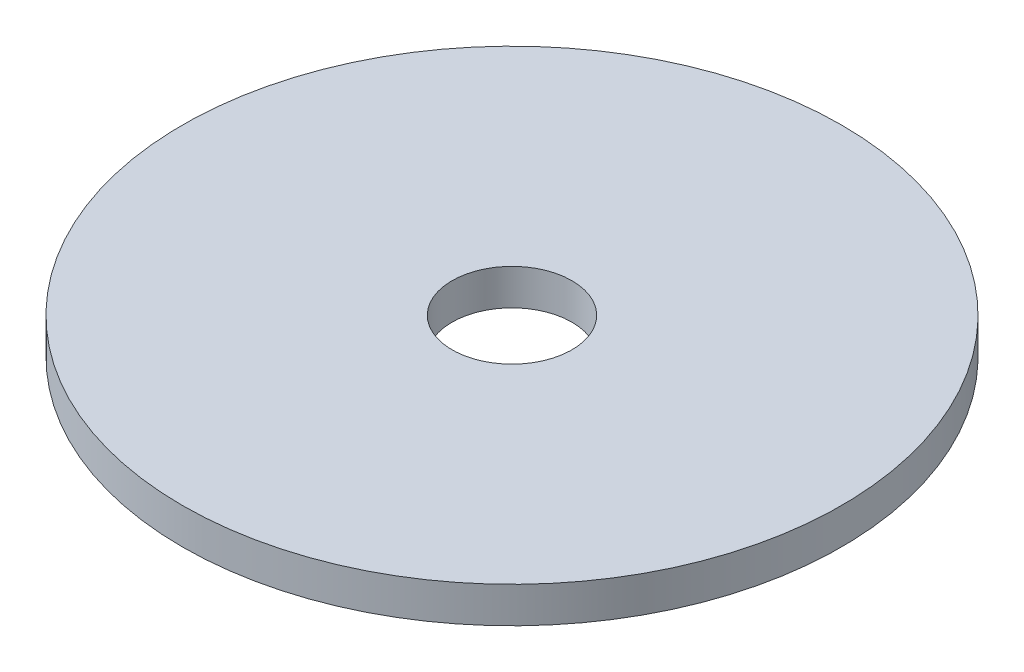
from build123d import *

# Parameters (mm, degrees)
SKETCH1_R           = 27.94
SKETCH1_R_2         = 5.08
BOSS_EXTRUDE1_DEPTH = 3.048


with BuildPart() as part:
    # Sketch1 → Boss-Extrude1 (new body)
    with BuildSketch(Plane(origin=(0, 0, 0), x_dir=(1, 0, 0), z_dir=(0, 1, 0))):
        with Locations(Location((0, 0, 0), (0, 0, 90))):
            Circle(SKETCH1_R)
        with Locations(Location((0, 0, 0), (0, 0, 90))):
            Circle(SKETCH1_R_2, mode=Mode.SUBTRACT)
    extrude(amount=BOSS_EXTRUDE1_DEPTH)


solid = part.part
